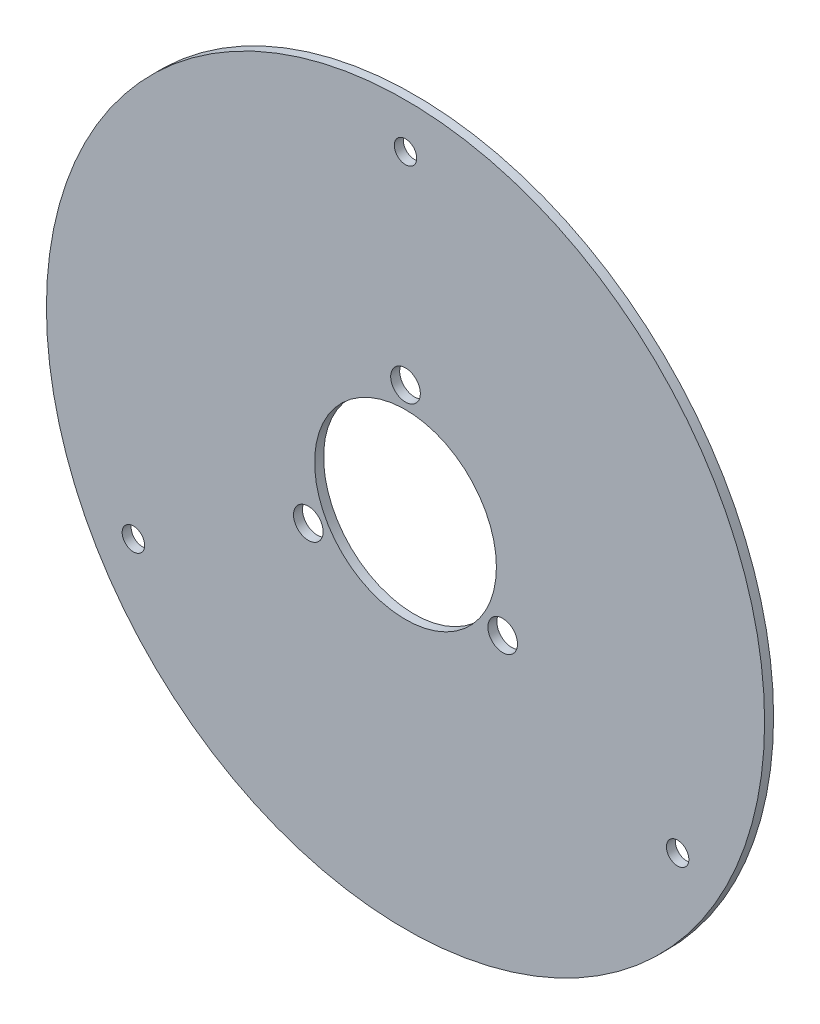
ISO-10303-21;
HEADER;
FILE_DESCRIPTION(('STEP AP214'),'2;1');
FILE_NAME('part.step','',(''),(''),'','','');
FILE_SCHEMA(('AUTOMOTIVE_DESIGN { 1 0 10303 214 1 1 1 1 }'));
ENDSEC;
DATA;
#1=APPLICATION_CONTEXT('core data for automotive mechanical design processes');
#2=APPLICATION_PROTOCOL_DEFINITION('international standard','automotive_design',2000,#1);
#3=PRODUCT_CONTEXT('',#1,'mechanical');
#4=PRODUCT('Part','Part','',(#3));
#5=PRODUCT_RELATED_PRODUCT_CATEGORY('part','',(#4));
#6=PRODUCT_DEFINITION_FORMATION('','',#4);
#7=PRODUCT_DEFINITION_CONTEXT('part definition',#1,'design');
#8=PRODUCT_DEFINITION('design','',#6,#7);
#9=PRODUCT_DEFINITION_SHAPE('','',#8);
#10=(LENGTH_UNIT() NAMED_UNIT(*) SI_UNIT(.MILLI.,.METRE.));
#11=(NAMED_UNIT(*) PLANE_ANGLE_UNIT() SI_UNIT($,.RADIAN.));
#12=(NAMED_UNIT(*) SI_UNIT($,.STERADIAN.) SOLID_ANGLE_UNIT());
#13=UNCERTAINTY_MEASURE_WITH_UNIT(LENGTH_MEASURE(1.E-05),#10,'distance_accuracy_value','');
#14=(GEOMETRIC_REPRESENTATION_CONTEXT(3) GLOBAL_UNCERTAINTY_ASSIGNED_CONTEXT((#13)) GLOBAL_UNIT_ASSIGNED_CONTEXT((#10,
#11,#12)) REPRESENTATION_CONTEXT('',''));
#15=CARTESIAN_POINT('',(0.,0.,0.));
#16=DIRECTION('',(0.,0.,1.));
#17=DIRECTION('',(1.,0.,0.));
#18=AXIS2_PLACEMENT_3D('',#15,#16,#17);
#19=CARTESIAN_POINT('',(0.,0.,2.));
#20=DIRECTION('',(0.,0.,1.));
#21=DIRECTION('',(1.,0.,0.));
#22=AXIS2_PLACEMENT_3D('',#19,#20,#21);
#23=PLANE('',#22);
#24=CARTESIAN_POINT('',(0.,0.,2.));
#25=DIRECTION('',(0.,0.,1.));
#26=DIRECTION('',(1.,0.,0.));
#27=AXIS2_PLACEMENT_3D('',#24,#25,#26);
#28=CIRCLE('',#27,80.);
#29=CARTESIAN_POINT('',(80.,0.,2.));
#30=VERTEX_POINT('',#29);
#31=EDGE_CURVE('E10',#30,#30,#28,.T.);
#32=ORIENTED_EDGE('',*,*,#31,.T.);
#33=EDGE_LOOP('',(#32));
#34=FACE_BOUND('',#33,.T.);
#35=CARTESIAN_POINT('',(-21.6506350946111,-12.4999999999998,2.));
#36=DIRECTION('',(0.,0.,1.));
#37=DIRECTION('',(1.,0.,0.));
#38=AXIS2_PLACEMENT_3D('',#35,#36,#37);
#39=CIRCLE('',#38,3.29999999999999);
#40=CARTESIAN_POINT('',(-18.3506350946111,-12.4999999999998,2.));
#41=VERTEX_POINT('',#40);
#42=EDGE_CURVE('E89',#41,#41,#39,.T.);
#43=ORIENTED_EDGE('',*,*,#42,.F.);
#44=EDGE_LOOP('',(#43));
#45=FACE_BOUND('',#44,.T.);
#46=CARTESIAN_POINT('',(21.6506350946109,-12.5000000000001,2.));
#47=DIRECTION('',(0.,0.,1.));
#48=DIRECTION('',(1.,0.,0.));
#49=AXIS2_PLACEMENT_3D('',#46,#47,#48);
#50=CIRCLE('',#49,3.29999999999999);
#51=CARTESIAN_POINT('',(24.9506350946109,-12.5000000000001,2.));
#52=VERTEX_POINT('',#51);
#53=EDGE_CURVE('E84',#52,#52,#50,.T.);
#54=ORIENTED_EDGE('',*,*,#53,.F.);
#55=EDGE_LOOP('',(#54));
#56=FACE_BOUND('',#55,.T.);
#57=CARTESIAN_POINT('',(0.,25.,2.));
#58=DIRECTION('',(0.,0.,1.));
#59=DIRECTION('',(1.,0.,0.));
#60=AXIS2_PLACEMENT_3D('',#57,#58,#59);
#61=CIRCLE('',#60,3.29999999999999);
#62=CARTESIAN_POINT('',(3.29999999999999,25.,2.));
#63=VERTEX_POINT('',#62);
#64=EDGE_CURVE('E56',#63,#63,#61,.T.);
#65=ORIENTED_EDGE('',*,*,#64,.F.);
#66=EDGE_LOOP('',(#65));
#67=FACE_BOUND('',#66,.T.);
#68=CARTESIAN_POINT('',(-60.621778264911,-34.9999999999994,2.));
#69=DIRECTION('',(0.,0.,1.));
#70=DIRECTION('',(1.,0.,0.));
#71=AXIS2_PLACEMENT_3D('',#68,#69,#70);
#72=CIRCLE('',#71,2.49999999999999);
#73=CARTESIAN_POINT('',(-58.1217782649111,-34.9999999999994,2.));
#74=VERTEX_POINT('',#73);
#75=EDGE_CURVE('E57',#74,#74,#72,.T.);
#76=ORIENTED_EDGE('',*,*,#75,.F.);
#77=EDGE_LOOP('',(#76));
#78=FACE_BOUND('',#77,.T.);
#79=CARTESIAN_POINT('',(60.6217782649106,-35.0000000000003,2.));
#80=DIRECTION('',(0.,0.,1.));
#81=DIRECTION('',(1.,0.,0.));
#82=AXIS2_PLACEMENT_3D('',#79,#80,#81);
#83=CIRCLE('',#82,2.49999999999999);
#84=CARTESIAN_POINT('',(63.1217782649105,-35.0000000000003,2.));
#85=VERTEX_POINT('',#84);
#86=EDGE_CURVE('E60',#85,#85,#83,.T.);
#87=ORIENTED_EDGE('',*,*,#86,.F.);
#88=EDGE_LOOP('',(#87));
#89=FACE_BOUND('',#88,.T.);
#90=CARTESIAN_POINT('',(0.,70.,2.));
#91=DIRECTION('',(0.,0.,1.));
#92=DIRECTION('',(1.,0.,0.));
#93=AXIS2_PLACEMENT_3D('',#90,#91,#92);
#94=CIRCLE('',#93,2.49999999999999);
#95=CARTESIAN_POINT('',(2.49999999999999,70.,2.));
#96=VERTEX_POINT('',#95);
#97=EDGE_CURVE('E61',#96,#96,#94,.T.);
#98=ORIENTED_EDGE('',*,*,#97,.F.);
#99=EDGE_LOOP('',(#98));
#100=FACE_BOUND('',#99,.T.);
#101=CARTESIAN_POINT('',(0.,0.,2.));
#102=DIRECTION('',(0.,0.,1.));
#103=DIRECTION('',(1.,0.,0.));
#104=AXIS2_PLACEMENT_3D('',#101,#102,#103);
#105=CIRCLE('',#104,20.25);
#106=CARTESIAN_POINT('',(20.25,0.,2.));
#107=VERTEX_POINT('',#106);
#108=EDGE_CURVE('E68',#107,#107,#105,.F.);
#109=ORIENTED_EDGE('',*,*,#108,.T.);
#110=EDGE_LOOP('',(#109));
#111=FACE_BOUND('',#110,.T.);
#112=ADVANCED_FACE('F36',(#34,#45,#56,#67,#78,#89,#100,#111),#23,.T.);
#113=CARTESIAN_POINT('',(0.,0.,0.));
#114=DIRECTION('',(0.,0.,1.));
#115=DIRECTION('',(1.,0.,0.));
#116=AXIS2_PLACEMENT_3D('',#113,#114,#115);
#117=PLANE('',#116);
#118=CARTESIAN_POINT('',(0.,0.,0.));
#119=DIRECTION('',(0.,0.,1.));
#120=DIRECTION('',(1.,0.,0.));
#121=AXIS2_PLACEMENT_3D('',#118,#119,#120);
#122=CIRCLE('',#121,80.);
#123=CARTESIAN_POINT('',(80.,0.,0.));
#124=VERTEX_POINT('',#123);
#125=EDGE_CURVE('E44',#124,#124,#122,.T.);
#126=ORIENTED_EDGE('',*,*,#125,.F.);
#127=EDGE_LOOP('',(#126));
#128=FACE_BOUND('',#127,.T.);
#129=CARTESIAN_POINT('',(-21.6506350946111,-12.4999999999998,0.));
#130=DIRECTION('',(0.,0.,1.));
#131=DIRECTION('',(1.,0.,0.));
#132=AXIS2_PLACEMENT_3D('',#129,#130,#131);
#133=CIRCLE('',#132,3.29999999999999);
#134=CARTESIAN_POINT('',(-18.3506350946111,-12.4999999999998,0.));
#135=VERTEX_POINT('',#134);
#136=EDGE_CURVE('E49',#135,#135,#133,.T.);
#137=ORIENTED_EDGE('',*,*,#136,.T.);
#138=EDGE_LOOP('',(#137));
#139=FACE_BOUND('',#138,.T.);
#140=CARTESIAN_POINT('',(21.6506350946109,-12.5000000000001,0.));
#141=DIRECTION('',(0.,0.,1.));
#142=DIRECTION('',(1.,0.,0.));
#143=AXIS2_PLACEMENT_3D('',#140,#141,#142);
#144=CIRCLE('',#143,3.29999999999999);
#145=CARTESIAN_POINT('',(24.9506350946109,-12.5000000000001,0.));
#146=VERTEX_POINT('',#145);
#147=EDGE_CURVE('E87',#146,#146,#144,.T.);
#148=ORIENTED_EDGE('',*,*,#147,.T.);
#149=EDGE_LOOP('',(#148));
#150=FACE_BOUND('',#149,.T.);
#151=CARTESIAN_POINT('',(0.,25.,0.));
#152=DIRECTION('',(0.,0.,1.));
#153=DIRECTION('',(1.,0.,0.));
#154=AXIS2_PLACEMENT_3D('',#151,#152,#153);
#155=CIRCLE('',#154,3.29999999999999);
#156=CARTESIAN_POINT('',(3.29999999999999,25.,0.));
#157=VERTEX_POINT('',#156);
#158=EDGE_CURVE('E81',#157,#157,#155,.T.);
#159=ORIENTED_EDGE('',*,*,#158,.T.);
#160=EDGE_LOOP('',(#159));
#161=FACE_BOUND('',#160,.T.);
#162=CARTESIAN_POINT('',(-60.621778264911,-34.9999999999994,0.));
#163=DIRECTION('',(0.,0.,1.));
#164=DIRECTION('',(1.,0.,0.));
#165=AXIS2_PLACEMENT_3D('',#162,#163,#164);
#166=CIRCLE('',#165,2.49999999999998);
#167=CARTESIAN_POINT('',(-58.1217782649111,-34.9999999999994,0.));
#168=VERTEX_POINT('',#167);
#169=EDGE_CURVE('E54',#168,#168,#166,.T.);
#170=ORIENTED_EDGE('',*,*,#169,.T.);
#171=EDGE_LOOP('',(#170));
#172=FACE_BOUND('',#171,.T.);
#173=CARTESIAN_POINT('',(60.6217782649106,-35.0000000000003,0.));
#174=DIRECTION('',(0.,0.,1.));
#175=DIRECTION('',(1.,0.,0.));
#176=AXIS2_PLACEMENT_3D('',#173,#174,#175);
#177=CIRCLE('',#176,2.49999999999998);
#178=CARTESIAN_POINT('',(63.1217782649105,-35.0000000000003,0.));
#179=VERTEX_POINT('',#178);
#180=EDGE_CURVE('E65',#179,#179,#177,.T.);
#181=ORIENTED_EDGE('',*,*,#180,.T.);
#182=EDGE_LOOP('',(#181));
#183=FACE_BOUND('',#182,.T.);
#184=CARTESIAN_POINT('',(0.,70.,0.));
#185=DIRECTION('',(0.,0.,1.));
#186=DIRECTION('',(1.,0.,0.));
#187=AXIS2_PLACEMENT_3D('',#184,#185,#186);
#188=CIRCLE('',#187,2.49999999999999);
#189=CARTESIAN_POINT('',(2.49999999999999,70.,0.));
#190=VERTEX_POINT('',#189);
#191=EDGE_CURVE('E58',#190,#190,#188,.T.);
#192=ORIENTED_EDGE('',*,*,#191,.T.);
#193=EDGE_LOOP('',(#192));
#194=FACE_BOUND('',#193,.T.);
#195=CARTESIAN_POINT('',(0.,0.,0.));
#196=DIRECTION('',(0.,0.,1.));
#197=DIRECTION('',(1.,0.,0.));
#198=AXIS2_PLACEMENT_3D('',#195,#196,#197);
#199=CIRCLE('',#198,20.25);
#200=CARTESIAN_POINT('',(20.25,0.,0.));
#201=VERTEX_POINT('',#200);
#202=EDGE_CURVE('E40',#201,#201,#199,.F.);
#203=ORIENTED_EDGE('',*,*,#202,.F.);
#204=EDGE_LOOP('',(#203));
#205=FACE_BOUND('',#204,.T.);
#206=ADVANCED_FACE('F96',(#128,#139,#150,#161,#172,#183,#194,#205),#117,.F.);
#207=CARTESIAN_POINT('',(0.,0.,2.));
#208=DIRECTION('',(0.,0.,-1.));
#209=DIRECTION('',(-1.,0.,0.));
#210=AXIS2_PLACEMENT_3D('',#207,#208,#209);
#211=CYLINDRICAL_SURFACE('',#210,80.);
#212=ORIENTED_EDGE('',*,*,#31,.F.);
#213=EDGE_LOOP('',(#212));
#214=FACE_BOUND('',#213,.T.);
#215=ORIENTED_EDGE('',*,*,#125,.T.);
#216=EDGE_LOOP('',(#215));
#217=FACE_BOUND('',#216,.T.);
#218=ADVANCED_FACE('F38',(#214,#217),#211,.T.);
#219=CARTESIAN_POINT('',(-21.6506350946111,-12.4999999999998,2.));
#220=DIRECTION('',(0.,0.,1.));
#221=DIRECTION('',(1.,0.,0.));
#222=AXIS2_PLACEMENT_3D('',#219,#220,#221);
#223=CYLINDRICAL_SURFACE('',#222,3.29999999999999);
#224=ORIENTED_EDGE('',*,*,#42,.T.);
#225=EDGE_LOOP('',(#224));
#226=FACE_BOUND('',#225,.T.);
#227=ORIENTED_EDGE('',*,*,#136,.F.);
#228=EDGE_LOOP('',(#227));
#229=FACE_BOUND('',#228,.T.);
#230=ADVANCED_FACE('F99',(#226,#229),#223,.F.);
#231=CARTESIAN_POINT('',(21.6506350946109,-12.5000000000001,2.));
#232=DIRECTION('',(0.,0.,1.));
#233=DIRECTION('',(1.,0.,0.));
#234=AXIS2_PLACEMENT_3D('',#231,#232,#233);
#235=CYLINDRICAL_SURFACE('',#234,3.29999999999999);
#236=ORIENTED_EDGE('',*,*,#53,.T.);
#237=EDGE_LOOP('',(#236));
#238=FACE_BOUND('',#237,.T.);
#239=ORIENTED_EDGE('',*,*,#147,.F.);
#240=EDGE_LOOP('',(#239));
#241=FACE_BOUND('',#240,.T.);
#242=ADVANCED_FACE('F101',(#238,#241),#235,.F.);
#243=CARTESIAN_POINT('',(0.,25.,2.));
#244=DIRECTION('',(0.,0.,1.));
#245=DIRECTION('',(1.,0.,0.));
#246=AXIS2_PLACEMENT_3D('',#243,#244,#245);
#247=CYLINDRICAL_SURFACE('',#246,3.29999999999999);
#248=ORIENTED_EDGE('',*,*,#64,.T.);
#249=EDGE_LOOP('',(#248));
#250=FACE_BOUND('',#249,.T.);
#251=ORIENTED_EDGE('',*,*,#158,.F.);
#252=EDGE_LOOP('',(#251));
#253=FACE_BOUND('',#252,.T.);
#254=ADVANCED_FACE('F107',(#250,#253),#247,.F.);
#255=CARTESIAN_POINT('',(-60.621778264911,-34.9999999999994,2.));
#256=DIRECTION('',(0.,0.,1.));
#257=DIRECTION('',(1.,0.,0.));
#258=AXIS2_PLACEMENT_3D('',#255,#256,#257);
#259=CYLINDRICAL_SURFACE('',#258,2.49999999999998);
#260=ORIENTED_EDGE('',*,*,#75,.T.);
#261=EDGE_LOOP('',(#260));
#262=FACE_BOUND('',#261,.T.);
#263=ORIENTED_EDGE('',*,*,#169,.F.);
#264=EDGE_LOOP('',(#263));
#265=FACE_BOUND('',#264,.T.);
#266=ADVANCED_FACE('F146',(#262,#265),#259,.F.);
#267=CARTESIAN_POINT('',(60.6217782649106,-35.0000000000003,2.));
#268=DIRECTION('',(0.,0.,1.));
#269=DIRECTION('',(1.,0.,0.));
#270=AXIS2_PLACEMENT_3D('',#267,#268,#269);
#271=CYLINDRICAL_SURFACE('',#270,2.49999999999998);
#272=ORIENTED_EDGE('',*,*,#86,.T.);
#273=EDGE_LOOP('',(#272));
#274=FACE_BOUND('',#273,.T.);
#275=ORIENTED_EDGE('',*,*,#180,.F.);
#276=EDGE_LOOP('',(#275));
#277=FACE_BOUND('',#276,.T.);
#278=ADVANCED_FACE('F141',(#274,#277),#271,.F.);
#279=CARTESIAN_POINT('',(0.,70.,2.));
#280=DIRECTION('',(0.,0.,1.));
#281=DIRECTION('',(1.,0.,0.));
#282=AXIS2_PLACEMENT_3D('',#279,#280,#281);
#283=CYLINDRICAL_SURFACE('',#282,2.49999999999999);
#284=ORIENTED_EDGE('',*,*,#97,.T.);
#285=EDGE_LOOP('',(#284));
#286=FACE_BOUND('',#285,.T.);
#287=ORIENTED_EDGE('',*,*,#191,.F.);
#288=EDGE_LOOP('',(#287));
#289=FACE_BOUND('',#288,.T.);
#290=ADVANCED_FACE('F133',(#286,#289),#283,.F.);
#291=CARTESIAN_POINT('',(0.,0.,12.));
#292=DIRECTION('',(0.,0.,-1.));
#293=DIRECTION('',(-1.,0.,0.));
#294=AXIS2_PLACEMENT_3D('',#291,#292,#293);
#295=CYLINDRICAL_SURFACE('',#294,20.25);
#296=ORIENTED_EDGE('',*,*,#108,.F.);
#297=EDGE_LOOP('',(#296));
#298=FACE_BOUND('',#297,.T.);
#299=ORIENTED_EDGE('',*,*,#202,.T.);
#300=EDGE_LOOP('',(#299));
#301=FACE_BOUND('',#300,.T.);
#302=ADVANCED_FACE('F130',(#298,#301),#295,.F.);
#303=CLOSED_SHELL('',(#112,#206,#218,#230,#242,#254,#266,#278,#290,#302));
#304=MANIFOLD_SOLID_BREP('B2',#303);
#305=ADVANCED_BREP_SHAPE_REPRESENTATION('',(#18,#304),#14);
#306=SHAPE_DEFINITION_REPRESENTATION(#9,#305);
ENDSEC;
END-ISO-10303-21;
